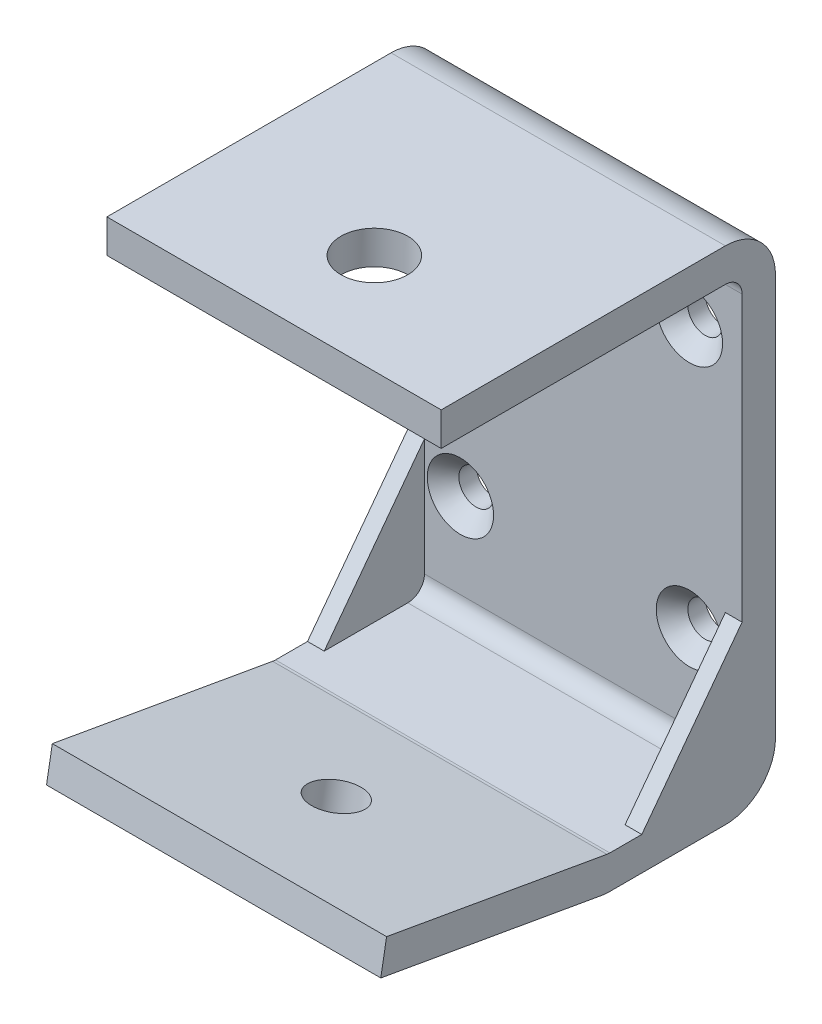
ISO-10303-21;
HEADER;
FILE_DESCRIPTION(('STEP AP214'),'2;1');
FILE_NAME('part.step','',(''),(''),'','','');
FILE_SCHEMA(('AUTOMOTIVE_DESIGN { 1 0 10303 214 1 1 1 1 }'));
ENDSEC;
DATA;
#1=APPLICATION_CONTEXT('core data for automotive mechanical design processes');
#2=APPLICATION_PROTOCOL_DEFINITION('international standard','automotive_design',2000,#1);
#3=PRODUCT_CONTEXT('',#1,'mechanical');
#4=PRODUCT('Part','Part','',(#3));
#5=PRODUCT_RELATED_PRODUCT_CATEGORY('part','',(#4));
#6=PRODUCT_DEFINITION_FORMATION('','',#4);
#7=PRODUCT_DEFINITION_CONTEXT('part definition',#1,'design');
#8=PRODUCT_DEFINITION('design','',#6,#7);
#9=PRODUCT_DEFINITION_SHAPE('','',#8);
#10=(LENGTH_UNIT() NAMED_UNIT(*) SI_UNIT(.MILLI.,.METRE.));
#11=(NAMED_UNIT(*) PLANE_ANGLE_UNIT() SI_UNIT($,.RADIAN.));
#12=(NAMED_UNIT(*) SI_UNIT($,.STERADIAN.) SOLID_ANGLE_UNIT());
#13=UNCERTAINTY_MEASURE_WITH_UNIT(LENGTH_MEASURE(1.E-05),#10,'distance_accuracy_value','');
#14=(GEOMETRIC_REPRESENTATION_CONTEXT(3) GLOBAL_UNCERTAINTY_ASSIGNED_CONTEXT((#13)) GLOBAL_UNIT_ASSIGNED_CONTEXT((#10,
#11,#12)) REPRESENTATION_CONTEXT('',''));
#15=CARTESIAN_POINT('',(0.,0.,0.));
#16=DIRECTION('',(0.,0.,1.));
#17=DIRECTION('',(1.,0.,0.));
#18=AXIS2_PLACEMENT_3D('',#15,#16,#17);
#19=CARTESIAN_POINT('',(31.75,3.175,3.175));
#20=DIRECTION('',(-1.,0.,0.));
#21=DIRECTION('',(0.,0.,1.));
#22=AXIS2_PLACEMENT_3D('',#19,#20,#21);
#23=CYLINDRICAL_SURFACE('',#22,3.175);
#24=DIRECTION('',(-1.,0.,0.));
#25=VECTOR('',#24,1.);
#26=CARTESIAN_POINT('',(31.75,3.175,0.));
#27=LINE('',#26,#25);
#28=CARTESIAN_POINT('',(28.575,3.175,0.));
#29=VERTEX_POINT('',#28);
#30=CARTESIAN_POINT('',(-28.575,3.175,0.));
#31=VERTEX_POINT('',#30);
#32=EDGE_CURVE('E327',#29,#31,#27,.T.);
#33=ORIENTED_EDGE('',*,*,#32,.T.);
#34=CARTESIAN_POINT('',(-28.575,3.175,3.175));
#35=DIRECTION('',(1.,0.,0.));
#36=DIRECTION('',(0.,0.,-1.));
#37=AXIS2_PLACEMENT_3D('',#34,#35,#36);
#38=CIRCLE('',#37,3.175);
#39=CARTESIAN_POINT('',(-28.575,0.,3.175));
#40=VERTEX_POINT('',#39);
#41=EDGE_CURVE('E198',#40,#31,#38,.T.);
#42=ORIENTED_EDGE('',*,*,#41,.F.);
#43=DIRECTION('',(-1.,0.,0.));
#44=VECTOR('',#43,1.);
#45=CARTESIAN_POINT('',(31.75,0.,3.175));
#46=LINE('',#45,#44);
#47=CARTESIAN_POINT('',(28.575,0.,3.175));
#48=VERTEX_POINT('',#47);
#49=EDGE_CURVE('E197',#48,#40,#46,.T.);
#50=ORIENTED_EDGE('',*,*,#49,.F.);
#51=CARTESIAN_POINT('',(28.575,3.175,3.175));
#52=DIRECTION('',(1.,0.,0.));
#53=DIRECTION('',(0.,0.,-1.));
#54=AXIS2_PLACEMENT_3D('',#51,#52,#53);
#55=CIRCLE('',#54,3.175);
#56=EDGE_CURVE('E210',#48,#29,#55,.T.);
#57=ORIENTED_EDGE('',*,*,#56,.T.);
#58=EDGE_LOOP('',(#33,#42,#50,#57));
#59=FACE_BOUND('',#58,.T.);
#60=ADVANCED_FACE('F39',(#59),#23,.F.);
#61=CARTESIAN_POINT('',(31.75,3.175,0.));
#62=DIRECTION('',(0.,0.,1.));
#63=DIRECTION('',(1.,0.,0.));
#64=AXIS2_PLACEMENT_3D('',#61,#62,#63);
#65=PLANE('',#64);
#66=CARTESIAN_POINT('',(-21.75,69.375,0.));
#67=DIRECTION('',(0.,0.,1.));
#68=DIRECTION('',(1.,0.,0.));
#69=AXIS2_PLACEMENT_3D('',#66,#67,#68);
#70=CIRCLE('',#69,6.3);
#71=CARTESIAN_POINT('',(-15.45,69.375,0.));
#72=VERTEX_POINT('',#71);
#73=EDGE_CURVE('E638',#72,#72,#70,.T.);
#74=ORIENTED_EDGE('',*,*,#73,.F.);
#75=EDGE_LOOP('',(#74));
#76=FACE_BOUND('',#75,.T.);
#77=CARTESIAN_POINT('',(21.75,69.375,0.));
#78=DIRECTION('',(0.,0.,1.));
#79=DIRECTION('',(1.,0.,0.));
#80=AXIS2_PLACEMENT_3D('',#77,#78,#79);
#81=CIRCLE('',#80,6.3);
#82=CARTESIAN_POINT('',(28.05,69.375,0.));
#83=VERTEX_POINT('',#82);
#84=EDGE_CURVE('E660',#83,#83,#81,.T.);
#85=ORIENTED_EDGE('',*,*,#84,.F.);
#86=EDGE_LOOP('',(#85));
#87=FACE_BOUND('',#86,.T.);
#88=CARTESIAN_POINT('',(21.75,19.375,0.));
#89=DIRECTION('',(0.,0.,1.));
#90=DIRECTION('',(1.,0.,0.));
#91=AXIS2_PLACEMENT_3D('',#88,#89,#90);
#92=CIRCLE('',#91,6.3);
#93=CARTESIAN_POINT('',(28.05,19.375,0.));
#94=VERTEX_POINT('',#93);
#95=EDGE_CURVE('E675',#94,#94,#92,.T.);
#96=ORIENTED_EDGE('',*,*,#95,.F.);
#97=EDGE_LOOP('',(#96));
#98=FACE_BOUND('',#97,.T.);
#99=CARTESIAN_POINT('',(-21.75,19.375,0.));
#100=DIRECTION('',(0.,0.,1.));
#101=DIRECTION('',(1.,0.,0.));
#102=AXIS2_PLACEMENT_3D('',#99,#100,#101);
#103=CIRCLE('',#102,6.3);
#104=CARTESIAN_POINT('',(-15.45,19.375,0.));
#105=VERTEX_POINT('',#104);
#106=EDGE_CURVE('E681',#105,#105,#103,.T.);
#107=ORIENTED_EDGE('',*,*,#106,.F.);
#108=EDGE_LOOP('',(#107));
#109=FACE_BOUND('',#108,.T.);
#110=DIRECTION('',(-1.,0.,0.));
#111=VECTOR('',#110,1.);
#112=CARTESIAN_POINT('',(-28.575,25.4,0.));
#113=LINE('',#112,#111);
#114=CARTESIAN_POINT('',(-28.575,25.4,0.));
#115=VERTEX_POINT('',#114);
#116=CARTESIAN_POINT('',(-31.75,25.4,0.));
#117=VERTEX_POINT('',#116);
#118=EDGE_CURVE('E185',#115,#117,#113,.T.);
#119=ORIENTED_EDGE('',*,*,#118,.F.);
#120=DIRECTION('',(0.,1.,0.));
#121=VECTOR('',#120,1.);
#122=CARTESIAN_POINT('',(-28.575,3.175,0.));
#123=LINE('',#122,#121);
#124=EDGE_CURVE('E192',#31,#115,#123,.T.);
#125=ORIENTED_EDGE('',*,*,#124,.F.);
#126=ORIENTED_EDGE('',*,*,#32,.F.);
#127=DIRECTION('',(0.,1.,0.));
#128=VECTOR('',#127,1.);
#129=CARTESIAN_POINT('',(28.575,3.175,0.));
#130=LINE('',#129,#128);
#131=CARTESIAN_POINT('',(28.575,25.4,0.));
#132=VERTEX_POINT('',#131);
#133=EDGE_CURVE('E62',#29,#132,#130,.T.);
#134=ORIENTED_EDGE('',*,*,#133,.T.);
#135=DIRECTION('',(1.,0.,0.));
#136=VECTOR('',#135,1.);
#137=CARTESIAN_POINT('',(28.575,25.4,0.));
#138=LINE('',#137,#136);
#139=CARTESIAN_POINT('',(31.75,25.4,0.));
#140=VERTEX_POINT('',#139);
#141=EDGE_CURVE('E219',#132,#140,#138,.T.);
#142=ORIENTED_EDGE('',*,*,#141,.T.);
#143=DIRECTION('',(0.,1.,0.));
#144=VECTOR('',#143,1.);
#145=CARTESIAN_POINT('',(31.75,3.175,0.));
#146=LINE('',#145,#144);
#147=CARTESIAN_POINT('',(31.75,79.375,0.));
#148=VERTEX_POINT('',#147);
#149=EDGE_CURVE('E239',#140,#148,#146,.T.);
#150=ORIENTED_EDGE('',*,*,#149,.T.);
#151=DIRECTION('',(-1.,0.,0.));
#152=VECTOR('',#151,1.);
#153=CARTESIAN_POINT('',(31.75,79.375,0.));
#154=LINE('',#153,#152);
#155=CARTESIAN_POINT('',(-31.75,79.375,0.));
#156=VERTEX_POINT('',#155);
#157=EDGE_CURVE('E330',#148,#156,#154,.T.);
#158=ORIENTED_EDGE('',*,*,#157,.T.);
#159=DIRECTION('',(0.,1.,0.));
#160=VECTOR('',#159,1.);
#161=CARTESIAN_POINT('',(-31.75,3.175,0.));
#162=LINE('',#161,#160);
#163=EDGE_CURVE('E277',#117,#156,#162,.T.);
#164=ORIENTED_EDGE('',*,*,#163,.F.);
#165=EDGE_LOOP('',(#119,#125,#126,#134,#142,#150,#158,#164));
#166=FACE_BOUND('',#165,.T.);
#167=ADVANCED_FACE('F419',(#76,#87,#98,#109,#166),#65,.T.);
#168=CARTESIAN_POINT('',(31.75,0.,25.1222234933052));
#169=DIRECTION('',(0.,1.,0.));
#170=DIRECTION('',(0.,0.,1.));
#171=AXIS2_PLACEMENT_3D('',#168,#169,#170);
#172=PLANE('',#171);
#173=DIRECTION('',(-1.,0.,0.));
#174=VECTOR('',#173,1.);
#175=CARTESIAN_POINT('',(-28.575,0.,19.05));
#176=LINE('',#175,#174);
#177=CARTESIAN_POINT('',(-28.575,0.,19.05));
#178=VERTEX_POINT('',#177);
#179=CARTESIAN_POINT('',(-31.75,0.,19.05));
#180=VERTEX_POINT('',#179);
#181=EDGE_CURVE('E176',#178,#180,#176,.T.);
#182=ORIENTED_EDGE('',*,*,#181,.T.);
#183=DIRECTION('',(0.,0.,-1.));
#184=VECTOR('',#183,1.);
#185=CARTESIAN_POINT('',(-31.75,0.,25.1222234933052));
#186=LINE('',#185,#184);
#187=CARTESIAN_POINT('',(-31.75,0.,25.1222234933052));
#188=VERTEX_POINT('',#187);
#189=EDGE_CURVE('E279',#188,#180,#186,.T.);
#190=ORIENTED_EDGE('',*,*,#189,.F.);
#191=DIRECTION('',(-1.,0.,0.));
#192=VECTOR('',#191,1.);
#193=CARTESIAN_POINT('',(31.75,0.,25.1222234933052));
#194=LINE('',#193,#192);
#195=CARTESIAN_POINT('',(31.75,0.,25.1222234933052));
#196=VERTEX_POINT('',#195);
#197=EDGE_CURVE('E324',#196,#188,#194,.T.);
#198=ORIENTED_EDGE('',*,*,#197,.F.);
#199=DIRECTION('',(0.,0.,-1.));
#200=VECTOR('',#199,1.);
#201=CARTESIAN_POINT('',(31.75,0.,25.1222234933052));
#202=LINE('',#201,#200);
#203=CARTESIAN_POINT('',(31.75,0.,19.05));
#204=VERTEX_POINT('',#203);
#205=EDGE_CURVE('E242',#196,#204,#202,.T.);
#206=ORIENTED_EDGE('',*,*,#205,.T.);
#207=DIRECTION('',(1.,0.,0.));
#208=VECTOR('',#207,1.);
#209=CARTESIAN_POINT('',(28.575,0.,19.05));
#210=LINE('',#209,#208);
#211=CARTESIAN_POINT('',(28.575,0.,19.05));
#212=VERTEX_POINT('',#211);
#213=EDGE_CURVE('E214',#212,#204,#210,.T.);
#214=ORIENTED_EDGE('',*,*,#213,.F.);
#215=DIRECTION('',(0.,0.,-1.));
#216=VECTOR('',#215,1.);
#217=CARTESIAN_POINT('',(28.575,0.,19.05));
#218=LINE('',#217,#216);
#219=EDGE_CURVE('E212',#212,#48,#218,.T.);
#220=ORIENTED_EDGE('',*,*,#219,.T.);
#221=ORIENTED_EDGE('',*,*,#49,.T.);
#222=DIRECTION('',(0.,0.,-1.));
#223=VECTOR('',#222,1.);
#224=CARTESIAN_POINT('',(-28.575,0.,19.05));
#225=LINE('',#224,#223);
#226=EDGE_CURVE('E189',#178,#40,#225,.T.);
#227=ORIENTED_EDGE('',*,*,#226,.F.);
#228=EDGE_LOOP('',(#182,#190,#198,#206,#214,#220,#221,#227));
#229=FACE_BOUND('',#228,.T.);
#230=ADVANCED_FACE('F195',(#229),#172,.T.);
#231=CARTESIAN_POINT('',(31.75,88.9,3.175));
#232=DIRECTION('',(0.,-1.,0.));
#233=DIRECTION('',(0.,0.,-1.));
#234=AXIS2_PLACEMENT_3D('',#231,#232,#233);
#235=PLANE('',#234);
#236=CARTESIAN_POINT('',(0.,88.9,38.1));
#237=DIRECTION('',(0.,1.,0.));
#238=DIRECTION('',(0.,0.,1.));
#239=AXIS2_PLACEMENT_3D('',#236,#237,#238);
#240=CIRCLE('',#239,6.35);
#241=CARTESIAN_POINT('',(0.,88.9,44.45));
#242=VERTEX_POINT('',#241);
#243=EDGE_CURVE('E224',#242,#242,#240,.T.);
#244=ORIENTED_EDGE('',*,*,#243,.F.);
#245=EDGE_LOOP('',(#244));
#246=FACE_BOUND('',#245,.T.);
#247=DIRECTION('',(0.,0.,1.));
#248=VECTOR('',#247,1.);
#249=CARTESIAN_POINT('',(-31.75,88.9,3.175));
#250=LINE('',#249,#248);
#251=CARTESIAN_POINT('',(-31.75,88.9,3.175));
#252=VERTEX_POINT('',#251);
#253=CARTESIAN_POINT('',(-31.75,88.9,57.15));
#254=VERTEX_POINT('',#253);
#255=EDGE_CURVE('E227',#252,#254,#250,.T.);
#256=ORIENTED_EDGE('',*,*,#255,.T.);
#257=DIRECTION('',(-1.,0.,0.));
#258=VECTOR('',#257,1.);
#259=CARTESIAN_POINT('',(31.75,88.9,57.15));
#260=LINE('',#259,#258);
#261=CARTESIAN_POINT('',(31.75,88.9,57.15));
#262=VERTEX_POINT('',#261);
#263=EDGE_CURVE('E12',#262,#254,#260,.T.);
#264=ORIENTED_EDGE('',*,*,#263,.F.);
#265=DIRECTION('',(0.,0.,1.));
#266=VECTOR('',#265,1.);
#267=CARTESIAN_POINT('',(31.75,88.9,3.175));
#268=LINE('',#267,#266);
#269=CARTESIAN_POINT('',(31.75,88.9,3.175));
#270=VERTEX_POINT('',#269);
#271=EDGE_CURVE('E228',#270,#262,#268,.T.);
#272=ORIENTED_EDGE('',*,*,#271,.F.);
#273=DIRECTION('',(-1.,0.,0.));
#274=VECTOR('',#273,1.);
#275=CARTESIAN_POINT('',(31.75,88.9,3.175));
#276=LINE('',#275,#274);
#277=EDGE_CURVE('E265',#270,#252,#276,.T.);
#278=ORIENTED_EDGE('',*,*,#277,.T.);
#279=EDGE_LOOP('',(#256,#264,#272,#278));
#280=FACE_BOUND('',#279,.T.);
#281=ADVANCED_FACE('F41',(#246,#280),#235,.F.);
#282=CARTESIAN_POINT('',(31.75,82.55,57.15));
#283=DIRECTION('',(0.,0.,1.));
#284=DIRECTION('',(1.,0.,0.));
#285=AXIS2_PLACEMENT_3D('',#282,#283,#284);
#286=PLANE('',#285);
#287=DIRECTION('',(0.,1.,0.));
#288=VECTOR('',#287,1.);
#289=CARTESIAN_POINT('',(-31.75,82.55,57.15));
#290=LINE('',#289,#288);
#291=CARTESIAN_POINT('',(-31.75,82.55,57.15));
#292=VERTEX_POINT('',#291);
#293=EDGE_CURVE('E268',#292,#254,#290,.T.);
#294=ORIENTED_EDGE('',*,*,#293,.F.);
#295=DIRECTION('',(-1.,0.,0.));
#296=VECTOR('',#295,1.);
#297=CARTESIAN_POINT('',(31.75,82.55,57.15));
#298=LINE('',#297,#296);
#299=CARTESIAN_POINT('',(31.75,82.55,57.15));
#300=VERTEX_POINT('',#299);
#301=EDGE_CURVE('E47',#300,#292,#298,.T.);
#302=ORIENTED_EDGE('',*,*,#301,.F.);
#303=DIRECTION('',(0.,1.,0.));
#304=VECTOR('',#303,1.);
#305=CARTESIAN_POINT('',(31.75,82.55,57.15));
#306=LINE('',#305,#304);
#307=EDGE_CURVE('E230',#300,#262,#306,.T.);
#308=ORIENTED_EDGE('',*,*,#307,.T.);
#309=ORIENTED_EDGE('',*,*,#263,.T.);
#310=EDGE_LOOP('',(#294,#302,#308,#309));
#311=FACE_BOUND('',#310,.T.);
#312=ADVANCED_FACE('F341',(#311),#286,.T.);
#313=CARTESIAN_POINT('',(31.75,82.55,3.175));
#314=DIRECTION('',(0.,-1.,0.));
#315=DIRECTION('',(0.,0.,-1.));
#316=AXIS2_PLACEMENT_3D('',#313,#314,#315);
#317=PLANE('',#316);
#318=CARTESIAN_POINT('',(0.,82.55,38.1));
#319=DIRECTION('',(0.,-1.,0.));
#320=DIRECTION('',(0.,0.,-1.));
#321=AXIS2_PLACEMENT_3D('',#318,#319,#320);
#322=CIRCLE('',#321,6.35);
#323=CARTESIAN_POINT('',(0.,82.55,31.75));
#324=VERTEX_POINT('',#323);
#325=EDGE_CURVE('E221',#324,#324,#322,.F.);
#326=ORIENTED_EDGE('',*,*,#325,.T.);
#327=EDGE_LOOP('',(#326));
#328=FACE_BOUND('',#327,.T.);
#329=DIRECTION('',(0.,0.,1.));
#330=VECTOR('',#329,1.);
#331=CARTESIAN_POINT('',(-31.75,82.55,3.175));
#332=LINE('',#331,#330);
#333=CARTESIAN_POINT('',(-31.75,82.55,3.175));
#334=VERTEX_POINT('',#333);
#335=EDGE_CURVE('E271',#334,#292,#332,.T.);
#336=ORIENTED_EDGE('',*,*,#335,.F.);
#337=DIRECTION('',(-1.,0.,0.));
#338=VECTOR('',#337,1.);
#339=CARTESIAN_POINT('',(31.75,82.55,3.175));
#340=LINE('',#339,#338);
#341=CARTESIAN_POINT('',(31.75,82.55,3.175));
#342=VERTEX_POINT('',#341);
#343=EDGE_CURVE('E333',#342,#334,#340,.T.);
#344=ORIENTED_EDGE('',*,*,#343,.F.);
#345=DIRECTION('',(0.,0.,1.));
#346=VECTOR('',#345,1.);
#347=CARTESIAN_POINT('',(31.75,82.55,3.175));
#348=LINE('',#347,#346);
#349=EDGE_CURVE('E234',#342,#300,#348,.T.);
#350=ORIENTED_EDGE('',*,*,#349,.T.);
#351=ORIENTED_EDGE('',*,*,#301,.T.);
#352=EDGE_LOOP('',(#336,#344,#350,#351));
#353=FACE_BOUND('',#352,.T.);
#354=ADVANCED_FACE('F337',(#328,#353),#317,.T.);
#355=CARTESIAN_POINT('',(31.75,79.375,3.175));
#356=DIRECTION('',(-1.,0.,0.));
#357=DIRECTION('',(0.,0.,1.));
#358=AXIS2_PLACEMENT_3D('',#355,#356,#357);
#359=CYLINDRICAL_SURFACE('',#358,3.175);
#360=CARTESIAN_POINT('',(-31.75,79.375,3.175));
#361=DIRECTION('',(1.,0.,0.));
#362=DIRECTION('',(0.,0.,-1.));
#363=AXIS2_PLACEMENT_3D('',#360,#361,#362);
#364=CIRCLE('',#363,3.175);
#365=EDGE_CURVE('E274',#156,#334,#364,.T.);
#366=ORIENTED_EDGE('',*,*,#365,.F.);
#367=ORIENTED_EDGE('',*,*,#157,.F.);
#368=CARTESIAN_POINT('',(31.75,79.375,3.175));
#369=DIRECTION('',(1.,0.,0.));
#370=DIRECTION('',(0.,0.,-1.));
#371=AXIS2_PLACEMENT_3D('',#368,#369,#370);
#372=CIRCLE('',#371,3.175);
#373=EDGE_CURVE('E237',#148,#342,#372,.T.);
#374=ORIENTED_EDGE('',*,*,#373,.T.);
#375=ORIENTED_EDGE('',*,*,#343,.T.);
#376=EDGE_LOOP('',(#366,#367,#374,#375));
#377=FACE_BOUND('',#376,.T.);
#378=ADVANCED_FACE('F349',(#377),#359,.F.);
#379=CARTESIAN_POINT('',(31.75,3.175,25.1222234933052));
#380=DIRECTION('',(-1.,0.,0.));
#381=DIRECTION('',(0.,0.,1.));
#382=AXIS2_PLACEMENT_3D('',#379,#380,#381);
#383=CYLINDRICAL_SURFACE('',#382,3.175);
#384=CARTESIAN_POINT('',(-31.75,3.175,25.1222234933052));
#385=DIRECTION('',(1.,0.,0.));
#386=DIRECTION('',(0.,0.,-1.));
#387=AXIS2_PLACEMENT_3D('',#384,#385,#386);
#388=CIRCLE('',#387,3.175);
#389=CARTESIAN_POINT('',(-31.75,0.0482353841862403,25.6735564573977));
#390=VERTEX_POINT('',#389);
#391=EDGE_CURVE('E281',#390,#188,#388,.T.);
#392=ORIENTED_EDGE('',*,*,#391,.F.);
#393=DIRECTION('',(-1.,0.,0.));
#394=VECTOR('',#393,1.);
#395=CARTESIAN_POINT('',(31.75,0.0482353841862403,25.6735564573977));
#396=LINE('',#395,#394);
#397=CARTESIAN_POINT('',(31.75,0.0482353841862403,25.6735564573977));
#398=VERTEX_POINT('',#397);
#399=EDGE_CURVE('E322',#398,#390,#396,.T.);
#400=ORIENTED_EDGE('',*,*,#399,.F.);
#401=CARTESIAN_POINT('',(31.75,3.175,25.1222234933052));
#402=DIRECTION('',(1.,0.,0.));
#403=DIRECTION('',(0.,0.,-1.));
#404=AXIS2_PLACEMENT_3D('',#401,#402,#403);
#405=CIRCLE('',#404,3.175);
#406=EDGE_CURVE('E244',#398,#196,#405,.T.);
#407=ORIENTED_EDGE('',*,*,#406,.T.);
#408=ORIENTED_EDGE('',*,*,#197,.T.);
#409=EDGE_LOOP('',(#392,#400,#407,#408));
#410=FACE_BOUND('',#409,.T.);
#411=ADVANCED_FACE('F396',(#410),#383,.F.);
#412=CARTESIAN_POINT('',(31.75,7.42755769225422,67.523772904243));
#413=DIRECTION('',(0.,0.984807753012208,-0.173648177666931));
#414=DIRECTION('',(0.,0.173648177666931,0.984807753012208));
#415=AXIS2_PLACEMENT_3D('',#412,#413,#414);
#416=PLANE('',#415);
#417=CARTESIAN_POINT('',(1.27328703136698E-12,3.51215941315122,45.3184458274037));
#418=DIRECTION('',(0.,0.984807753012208,-0.173648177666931));
#419=DIRECTION('',(0.,0.173648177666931,0.984807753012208));
#420=AXIS2_PLACEMENT_3D('',#417,#418,#419);
#421=CIRCLE('',#420,4.7625);
#422=CARTESIAN_POINT('',(1.27328703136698E-12,4.33915885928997,50.0085927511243));
#423=VERTEX_POINT('',#422);
#424=EDGE_CURVE('E205',#423,#423,#421,.F.);
#425=ORIENTED_EDGE('',*,*,#424,.T.);
#426=EDGE_LOOP('',(#425));
#427=FACE_BOUND('',#426,.T.);
#428=DIRECTION('',(0.,-0.173648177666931,-0.984807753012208));
#429=VECTOR('',#428,1.);
#430=CARTESIAN_POINT('',(-31.75,7.42755769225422,67.523772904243));
#431=LINE('',#430,#429);
#432=CARTESIAN_POINT('',(-31.75,7.42755769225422,67.523772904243));
#433=VERTEX_POINT('',#432);
#434=EDGE_CURVE('E284',#433,#390,#431,.T.);
#435=ORIENTED_EDGE('',*,*,#434,.F.);
#436=DIRECTION('',(-1.,0.,0.));
#437=VECTOR('',#436,1.);
#438=CARTESIAN_POINT('',(31.75,7.42755769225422,67.523772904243));
#439=LINE('',#438,#437);
#440=CARTESIAN_POINT('',(31.75,7.42755769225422,67.523772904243));
#441=VERTEX_POINT('',#440);
#442=EDGE_CURVE('E320',#441,#433,#439,.T.);
#443=ORIENTED_EDGE('',*,*,#442,.F.);
#444=DIRECTION('',(0.,-0.173648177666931,-0.984807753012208));
#445=VECTOR('',#444,1.);
#446=CARTESIAN_POINT('',(31.75,7.42755769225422,67.523772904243));
#447=LINE('',#446,#445);
#448=EDGE_CURVE('E247',#441,#398,#447,.T.);
#449=ORIENTED_EDGE('',*,*,#448,.T.);
#450=ORIENTED_EDGE('',*,*,#399,.T.);
#451=EDGE_LOOP('',(#435,#443,#449,#450));
#452=FACE_BOUND('',#451,.T.);
#453=ADVANCED_FACE('F393',(#427,#452),#416,.T.);
#454=CARTESIAN_POINT('',(31.75,1.1740284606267,68.626438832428));
#455=DIRECTION('',(0.,0.17364817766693,0.984807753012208));
#456=DIRECTION('',(0.,-0.984807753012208,0.17364817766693));
#457=AXIS2_PLACEMENT_3D('',#454,#455,#456);
#458=PLANE('',#457);
#459=DIRECTION('',(0.,0.984807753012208,-0.17364817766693));
#460=VECTOR('',#459,1.);
#461=CARTESIAN_POINT('',(-31.75,1.1740284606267,68.626438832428));
#462=LINE('',#461,#460);
#463=CARTESIAN_POINT('',(-31.75,1.1740284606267,68.626438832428));
#464=VERTEX_POINT('',#463);
#465=EDGE_CURVE('E287',#464,#433,#462,.T.);
#466=ORIENTED_EDGE('',*,*,#465,.F.);
#467=DIRECTION('',(-1.,0.,0.));
#468=VECTOR('',#467,1.);
#469=CARTESIAN_POINT('',(31.75,1.1740284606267,68.626438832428));
#470=LINE('',#469,#468);
#471=CARTESIAN_POINT('',(31.75,1.1740284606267,68.626438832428));
#472=VERTEX_POINT('',#471);
#473=EDGE_CURVE('E318',#472,#464,#470,.T.);
#474=ORIENTED_EDGE('',*,*,#473,.F.);
#475=DIRECTION('',(0.,0.984807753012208,-0.17364817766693));
#476=VECTOR('',#475,1.);
#477=CARTESIAN_POINT('',(31.75,1.1740284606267,68.626438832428));
#478=LINE('',#477,#476);
#479=EDGE_CURVE('E250',#472,#441,#478,.T.);
#480=ORIENTED_EDGE('',*,*,#479,.T.);
#481=ORIENTED_EDGE('',*,*,#442,.T.);
#482=EDGE_LOOP('',(#466,#474,#480,#481));
#483=FACE_BOUND('',#482,.T.);
#484=ADVANCED_FACE('F389',(#483),#458,.T.);
#485=CARTESIAN_POINT('',(31.75,1.1740284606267,68.626438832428));
#486=DIRECTION('',(0.,0.984807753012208,-0.173648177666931));
#487=DIRECTION('',(0.,0.173648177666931,0.984807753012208));
#488=AXIS2_PLACEMENT_3D('',#485,#486,#487);
#489=PLANE('',#488);
#490=CARTESIAN_POINT('',(1.27328703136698E-12,-2.7413698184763,46.4211117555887));
#491=DIRECTION('',(0.,-0.984807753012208,0.173648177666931));
#492=DIRECTION('',(0.,-0.173648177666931,-0.984807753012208));
#493=AXIS2_PLACEMENT_3D('',#490,#491,#492);
#494=CIRCLE('',#493,4.7625);
#495=CARTESIAN_POINT('',(1.27328703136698E-12,-3.56836926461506,41.730964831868));
#496=VERTEX_POINT('',#495);
#497=EDGE_CURVE('E691',#496,#496,#494,.T.);
#498=ORIENTED_EDGE('',*,*,#497,.F.);
#499=EDGE_LOOP('',(#498));
#500=FACE_BOUND('',#499,.T.);
#501=DIRECTION('',(0.,-0.173648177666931,-0.984807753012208));
#502=VECTOR('',#501,1.);
#503=CARTESIAN_POINT('',(-31.75,1.1740284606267,68.626438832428));
#504=LINE('',#503,#502);
#505=CARTESIAN_POINT('',(-31.75,-6.20529384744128,26.7762223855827));
#506=VERTEX_POINT('',#505);
#507=EDGE_CURVE('E290',#464,#506,#504,.T.);
#508=ORIENTED_EDGE('',*,*,#507,.T.);
#509=DIRECTION('',(-1.,0.,0.));
#510=VECTOR('',#509,1.);
#511=CARTESIAN_POINT('',(31.75,-6.20529384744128,26.7762223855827));
#512=LINE('',#511,#510);
#513=CARTESIAN_POINT('',(31.75,-6.20529384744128,26.7762223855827));
#514=VERTEX_POINT('',#513);
#515=EDGE_CURVE('E315',#514,#506,#512,.T.);
#516=ORIENTED_EDGE('',*,*,#515,.F.);
#517=DIRECTION('',(0.,-0.173648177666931,-0.984807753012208));
#518=VECTOR('',#517,1.);
#519=CARTESIAN_POINT('',(31.75,1.1740284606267,68.626438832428));
#520=LINE('',#519,#518);
#521=EDGE_CURVE('E253',#472,#514,#520,.T.);
#522=ORIENTED_EDGE('',*,*,#521,.F.);
#523=ORIENTED_EDGE('',*,*,#473,.T.);
#524=EDGE_LOOP('',(#508,#516,#522,#523));
#525=FACE_BOUND('',#524,.T.);
#526=ADVANCED_FACE('F385',(#500,#525),#489,.F.);
#527=CARTESIAN_POINT('',(31.75,3.175,25.1222234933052));
#528=DIRECTION('',(-1.,0.,0.));
#529=DIRECTION('',(0.,0.,1.));
#530=AXIS2_PLACEMENT_3D('',#527,#528,#529);
#531=CYLINDRICAL_SURFACE('',#530,9.525);
#532=CARTESIAN_POINT('',(-31.75,3.175,25.1222234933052));
#533=DIRECTION('',(1.,0.,0.));
#534=DIRECTION('',(0.,0.,-1.));
#535=AXIS2_PLACEMENT_3D('',#532,#533,#534);
#536=CIRCLE('',#535,9.525);
#537=CARTESIAN_POINT('',(-31.75,-6.35,25.1222234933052));
#538=VERTEX_POINT('',#537);
#539=EDGE_CURVE('E292',#506,#538,#536,.T.);
#540=ORIENTED_EDGE('',*,*,#539,.T.);
#541=DIRECTION('',(-1.,0.,0.));
#542=VECTOR('',#541,1.);
#543=CARTESIAN_POINT('',(31.75,-6.35,25.1222234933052));
#544=LINE('',#543,#542);
#545=CARTESIAN_POINT('',(31.75,-6.35,25.1222234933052));
#546=VERTEX_POINT('',#545);
#547=EDGE_CURVE('E312',#546,#538,#544,.T.);
#548=ORIENTED_EDGE('',*,*,#547,.F.);
#549=CARTESIAN_POINT('',(31.75,3.175,25.1222234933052));
#550=DIRECTION('',(1.,0.,0.));
#551=DIRECTION('',(0.,0.,-1.));
#552=AXIS2_PLACEMENT_3D('',#549,#550,#551);
#553=CIRCLE('',#552,9.525);
#554=EDGE_CURVE('E255',#514,#546,#553,.T.);
#555=ORIENTED_EDGE('',*,*,#554,.F.);
#556=ORIENTED_EDGE('',*,*,#515,.T.);
#557=EDGE_LOOP('',(#540,#548,#555,#556));
#558=FACE_BOUND('',#557,.T.);
#559=ADVANCED_FACE('F381',(#558),#531,.T.);
#560=CARTESIAN_POINT('',(31.75,-6.35,25.1222234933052));
#561=DIRECTION('',(0.,1.,0.));
#562=DIRECTION('',(0.,0.,1.));
#563=AXIS2_PLACEMENT_3D('',#560,#561,#562);
#564=PLANE('',#563);
#565=DIRECTION('',(0.,0.,-1.));
#566=VECTOR('',#565,1.);
#567=CARTESIAN_POINT('',(-31.75,-6.35,25.1222234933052));
#568=LINE('',#567,#566);
#569=CARTESIAN_POINT('',(-31.75,-6.35,3.175));
#570=VERTEX_POINT('',#569);
#571=EDGE_CURVE('E294',#538,#570,#568,.T.);
#572=ORIENTED_EDGE('',*,*,#571,.T.);
#573=DIRECTION('',(-1.,0.,0.));
#574=VECTOR('',#573,1.);
#575=CARTESIAN_POINT('',(31.75,-6.35,3.175));
#576=LINE('',#575,#574);
#577=CARTESIAN_POINT('',(31.75,-6.35,3.175));
#578=VERTEX_POINT('',#577);
#579=EDGE_CURVE('E309',#578,#570,#576,.T.);
#580=ORIENTED_EDGE('',*,*,#579,.F.);
#581=DIRECTION('',(0.,0.,-1.));
#582=VECTOR('',#581,1.);
#583=CARTESIAN_POINT('',(31.75,-6.35,25.1222234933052));
#584=LINE('',#583,#582);
#585=EDGE_CURVE('E257',#546,#578,#584,.T.);
#586=ORIENTED_EDGE('',*,*,#585,.F.);
#587=ORIENTED_EDGE('',*,*,#547,.T.);
#588=EDGE_LOOP('',(#572,#580,#586,#587));
#589=FACE_BOUND('',#588,.T.);
#590=ADVANCED_FACE('F376',(#589),#564,.F.);
#591=CARTESIAN_POINT('',(31.75,3.175,3.175));
#592=DIRECTION('',(-1.,0.,0.));
#593=DIRECTION('',(0.,0.,1.));
#594=AXIS2_PLACEMENT_3D('',#591,#592,#593);
#595=CYLINDRICAL_SURFACE('',#594,9.525);
#596=CARTESIAN_POINT('',(-31.75,3.175,3.175));
#597=DIRECTION('',(1.,0.,0.));
#598=DIRECTION('',(0.,0.,-1.));
#599=AXIS2_PLACEMENT_3D('',#596,#597,#598);
#600=CIRCLE('',#599,9.525);
#601=CARTESIAN_POINT('',(-31.75,3.175,-6.35));
#602=VERTEX_POINT('',#601);
#603=EDGE_CURVE('E296',#570,#602,#600,.T.);
#604=ORIENTED_EDGE('',*,*,#603,.T.);
#605=DIRECTION('',(-1.,0.,0.));
#606=VECTOR('',#605,1.);
#607=CARTESIAN_POINT('',(31.75,3.175,-6.35));
#608=LINE('',#607,#606);
#609=CARTESIAN_POINT('',(31.75,3.175,-6.35));
#610=VERTEX_POINT('',#609);
#611=EDGE_CURVE('E306',#610,#602,#608,.T.);
#612=ORIENTED_EDGE('',*,*,#611,.F.);
#613=CARTESIAN_POINT('',(31.75,3.175,3.175));
#614=DIRECTION('',(1.,0.,0.));
#615=DIRECTION('',(0.,0.,-1.));
#616=AXIS2_PLACEMENT_3D('',#613,#614,#615);
#617=CIRCLE('',#616,9.525);
#618=EDGE_CURVE('E259',#578,#610,#617,.T.);
#619=ORIENTED_EDGE('',*,*,#618,.F.);
#620=ORIENTED_EDGE('',*,*,#579,.T.);
#621=EDGE_LOOP('',(#604,#612,#619,#620));
#622=FACE_BOUND('',#621,.T.);
#623=ADVANCED_FACE('F370',(#622),#595,.T.);
#624=CARTESIAN_POINT('',(31.75,3.175,-6.35));
#625=DIRECTION('',(0.,0.,1.));
#626=DIRECTION('',(1.,0.,0.));
#627=AXIS2_PLACEMENT_3D('',#624,#625,#626);
#628=PLANE('',#627);
#629=CARTESIAN_POINT('',(-21.75,69.375,-6.35));
#630=DIRECTION('',(0.,0.,1.));
#631=DIRECTION('',(1.,0.,0.));
#632=AXIS2_PLACEMENT_3D('',#629,#630,#631);
#633=CIRCLE('',#632,3.29999999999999);
#634=CARTESIAN_POINT('',(-18.45,69.375,-6.35));
#635=VERTEX_POINT('',#634);
#636=EDGE_CURVE('E640',#635,#635,#633,.T.);
#637=ORIENTED_EDGE('',*,*,#636,.T.);
#638=EDGE_LOOP('',(#637));
#639=FACE_BOUND('',#638,.T.);
#640=CARTESIAN_POINT('',(21.75,69.375,-6.35));
#641=DIRECTION('',(0.,0.,1.));
#642=DIRECTION('',(1.,0.,0.));
#643=AXIS2_PLACEMENT_3D('',#640,#641,#642);
#644=CIRCLE('',#643,3.29999999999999);
#645=CARTESIAN_POINT('',(25.05,69.375,-6.35));
#646=VERTEX_POINT('',#645);
#647=EDGE_CURVE('E659',#646,#646,#644,.T.);
#648=ORIENTED_EDGE('',*,*,#647,.T.);
#649=EDGE_LOOP('',(#648));
#650=FACE_BOUND('',#649,.T.);
#651=CARTESIAN_POINT('',(21.75,19.375,-6.35));
#652=DIRECTION('',(0.,0.,1.));
#653=DIRECTION('',(1.,0.,0.));
#654=AXIS2_PLACEMENT_3D('',#651,#652,#653);
#655=CIRCLE('',#654,3.29999999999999);
#656=CARTESIAN_POINT('',(25.05,19.375,-6.35));
#657=VERTEX_POINT('',#656);
#658=EDGE_CURVE('E674',#657,#657,#655,.T.);
#659=ORIENTED_EDGE('',*,*,#658,.T.);
#660=EDGE_LOOP('',(#659));
#661=FACE_BOUND('',#660,.T.);
#662=CARTESIAN_POINT('',(-21.75,19.375,-6.35));
#663=DIRECTION('',(0.,0.,1.));
#664=DIRECTION('',(1.,0.,0.));
#665=AXIS2_PLACEMENT_3D('',#662,#663,#664);
#666=CIRCLE('',#665,3.29999999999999);
#667=CARTESIAN_POINT('',(-18.45,19.375,-6.35));
#668=VERTEX_POINT('',#667);
#669=EDGE_CURVE('E688',#668,#668,#666,.T.);
#670=ORIENTED_EDGE('',*,*,#669,.T.);
#671=EDGE_LOOP('',(#670));
#672=FACE_BOUND('',#671,.T.);
#673=DIRECTION('',(0.,1.,0.));
#674=VECTOR('',#673,1.);
#675=CARTESIAN_POINT('',(-31.75,3.175,-6.35));
#676=LINE('',#675,#674);
#677=CARTESIAN_POINT('',(-31.75,79.375,-6.35));
#678=VERTEX_POINT('',#677);
#679=EDGE_CURVE('E298',#602,#678,#676,.T.);
#680=ORIENTED_EDGE('',*,*,#679,.T.);
#681=DIRECTION('',(-1.,0.,0.));
#682=VECTOR('',#681,1.);
#683=CARTESIAN_POINT('',(31.75,79.375,-6.35));
#684=LINE('',#683,#682);
#685=CARTESIAN_POINT('',(31.75,79.375,-6.35));
#686=VERTEX_POINT('',#685);
#687=EDGE_CURVE('E303',#686,#678,#684,.T.);
#688=ORIENTED_EDGE('',*,*,#687,.F.);
#689=DIRECTION('',(0.,1.,0.));
#690=VECTOR('',#689,1.);
#691=CARTESIAN_POINT('',(31.75,3.175,-6.35));
#692=LINE('',#691,#690);
#693=EDGE_CURVE('E261',#610,#686,#692,.T.);
#694=ORIENTED_EDGE('',*,*,#693,.F.);
#695=ORIENTED_EDGE('',*,*,#611,.T.);
#696=EDGE_LOOP('',(#680,#688,#694,#695));
#697=FACE_BOUND('',#696,.T.);
#698=ADVANCED_FACE('F366',(#639,#650,#661,#672,#697),#628,.F.);
#699=CARTESIAN_POINT('',(31.75,79.375,3.175));
#700=DIRECTION('',(-1.,0.,0.));
#701=DIRECTION('',(0.,0.,1.));
#702=AXIS2_PLACEMENT_3D('',#699,#700,#701);
#703=CYLINDRICAL_SURFACE('',#702,9.525);
#704=CARTESIAN_POINT('',(-31.75,79.375,3.175));
#705=DIRECTION('',(1.,0.,0.));
#706=DIRECTION('',(0.,0.,-1.));
#707=AXIS2_PLACEMENT_3D('',#704,#705,#706);
#708=CIRCLE('',#707,9.525);
#709=EDGE_CURVE('E231',#678,#252,#708,.T.);
#710=ORIENTED_EDGE('',*,*,#709,.T.);
#711=ORIENTED_EDGE('',*,*,#277,.F.);
#712=CARTESIAN_POINT('',(31.75,79.375,3.175));
#713=DIRECTION('',(1.,0.,0.));
#714=DIRECTION('',(0.,0.,-1.));
#715=AXIS2_PLACEMENT_3D('',#712,#713,#714);
#716=CIRCLE('',#715,9.525);
#717=EDGE_CURVE('E263',#686,#270,#716,.T.);
#718=ORIENTED_EDGE('',*,*,#717,.F.);
#719=ORIENTED_EDGE('',*,*,#687,.T.);
#720=EDGE_LOOP('',(#710,#711,#718,#719));
#721=FACE_BOUND('',#720,.T.);
#722=ADVANCED_FACE('F362',(#721),#703,.T.);
#723=CARTESIAN_POINT('',(31.75,79.375,3.175));
#724=DIRECTION('',(1.,0.,0.));
#725=DIRECTION('',(0.,0.,-1.));
#726=AXIS2_PLACEMENT_3D('',#723,#724,#725);
#727=PLANE('',#726);
#728=ORIENTED_EDGE('',*,*,#149,.F.);
#729=DIRECTION('',(0.,0.8,-0.6));
#730=VECTOR('',#729,1.);
#731=CARTESIAN_POINT('',(31.75,0.,19.05));
#732=LINE('',#731,#730);
#733=EDGE_CURVE('E184',#204,#140,#732,.T.);
#734=ORIENTED_EDGE('',*,*,#733,.F.);
#735=ORIENTED_EDGE('',*,*,#205,.F.);
#736=ORIENTED_EDGE('',*,*,#406,.F.);
#737=ORIENTED_EDGE('',*,*,#448,.F.);
#738=ORIENTED_EDGE('',*,*,#479,.F.);
#739=ORIENTED_EDGE('',*,*,#521,.T.);
#740=ORIENTED_EDGE('',*,*,#554,.T.);
#741=ORIENTED_EDGE('',*,*,#585,.T.);
#742=ORIENTED_EDGE('',*,*,#618,.T.);
#743=ORIENTED_EDGE('',*,*,#693,.T.);
#744=ORIENTED_EDGE('',*,*,#717,.T.);
#745=ORIENTED_EDGE('',*,*,#271,.T.);
#746=ORIENTED_EDGE('',*,*,#307,.F.);
#747=ORIENTED_EDGE('',*,*,#349,.F.);
#748=ORIENTED_EDGE('',*,*,#373,.F.);
#749=EDGE_LOOP('',(#728,#734,#735,#736,#737,#738,#739,#740,#741,#742,#743,#744,#745,#746,#747,#748));
#750=FACE_BOUND('',#749,.T.);
#751=ADVANCED_FACE('F353',(#750),#727,.T.);
#752=CARTESIAN_POINT('',(-31.75,79.375,3.175));
#753=DIRECTION('',(1.,0.,0.));
#754=DIRECTION('',(0.,0.,-1.));
#755=AXIS2_PLACEMENT_3D('',#752,#753,#754);
#756=PLANE('',#755);
#757=ORIENTED_EDGE('',*,*,#255,.F.);
#758=ORIENTED_EDGE('',*,*,#709,.F.);
#759=ORIENTED_EDGE('',*,*,#679,.F.);
#760=ORIENTED_EDGE('',*,*,#603,.F.);
#761=ORIENTED_EDGE('',*,*,#571,.F.);
#762=ORIENTED_EDGE('',*,*,#539,.F.);
#763=ORIENTED_EDGE('',*,*,#507,.F.);
#764=ORIENTED_EDGE('',*,*,#465,.T.);
#765=ORIENTED_EDGE('',*,*,#434,.T.);
#766=ORIENTED_EDGE('',*,*,#391,.T.);
#767=ORIENTED_EDGE('',*,*,#189,.T.);
#768=DIRECTION('',(0.,0.8,-0.6));
#769=VECTOR('',#768,1.);
#770=CARTESIAN_POINT('',(-31.75,0.,19.05));
#771=LINE('',#770,#769);
#772=EDGE_CURVE('E54',#180,#117,#771,.T.);
#773=ORIENTED_EDGE('',*,*,#772,.T.);
#774=ORIENTED_EDGE('',*,*,#163,.T.);
#775=ORIENTED_EDGE('',*,*,#365,.T.);
#776=ORIENTED_EDGE('',*,*,#335,.T.);
#777=ORIENTED_EDGE('',*,*,#293,.T.);
#778=EDGE_LOOP('',(#757,#758,#759,#760,#761,#762,#763,#764,#765,#766,#767,#773,#774,#775,#776,#777));
#779=FACE_BOUND('',#778,.T.);
#780=ADVANCED_FACE('F344',(#779),#756,.F.);
#781=CARTESIAN_POINT('',(0.,-6.35100000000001,38.1000000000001));
#782=DIRECTION('',(0.,1.,0.));
#783=DIRECTION('',(0.,0.,1.));
#784=AXIS2_PLACEMENT_3D('',#781,#782,#783);
#785=CYLINDRICAL_SURFACE('',#784,6.35);
#786=ORIENTED_EDGE('',*,*,#325,.F.);
#787=EDGE_LOOP('',(#786));
#788=FACE_BOUND('',#787,.T.);
#789=ORIENTED_EDGE('',*,*,#243,.T.);
#790=EDGE_LOOP('',(#789));
#791=FACE_BOUND('',#790,.T.);
#792=ADVANCED_FACE('F416',(#788,#791),#785,.F.);
#793=CARTESIAN_POINT('',(28.575,0.,19.05));
#794=DIRECTION('',(0.,-0.6,-0.8));
#795=DIRECTION('',(0.,0.8,-0.6));
#796=AXIS2_PLACEMENT_3D('',#793,#794,#795);
#797=PLANE('',#796);
#798=ORIENTED_EDGE('',*,*,#733,.T.);
#799=ORIENTED_EDGE('',*,*,#141,.F.);
#800=DIRECTION('',(0.,0.8,-0.6));
#801=VECTOR('',#800,1.);
#802=CARTESIAN_POINT('',(28.575,0.,19.05));
#803=LINE('',#802,#801);
#804=EDGE_CURVE('E207',#212,#132,#803,.T.);
#805=ORIENTED_EDGE('',*,*,#804,.F.);
#806=ORIENTED_EDGE('',*,*,#213,.T.);
#807=EDGE_LOOP('',(#798,#799,#805,#806));
#808=FACE_BOUND('',#807,.T.);
#809=ADVANCED_FACE('F402',(#808),#797,.F.);
#810=CARTESIAN_POINT('',(28.575,3.175,3.175));
#811=DIRECTION('',(1.,0.,0.));
#812=DIRECTION('',(0.,0.,-1.));
#813=AXIS2_PLACEMENT_3D('',#810,#811,#812);
#814=PLANE('',#813);
#815=ORIENTED_EDGE('',*,*,#804,.T.);
#816=ORIENTED_EDGE('',*,*,#133,.F.);
#817=ORIENTED_EDGE('',*,*,#56,.F.);
#818=ORIENTED_EDGE('',*,*,#219,.F.);
#819=EDGE_LOOP('',(#815,#816,#817,#818));
#820=FACE_BOUND('',#819,.T.);
#821=ADVANCED_FACE('F408',(#820),#814,.F.);
#822=CARTESIAN_POINT('',(-28.575,0.,19.05));
#823=DIRECTION('',(0.,0.6,0.8));
#824=DIRECTION('',(0.,-0.8,0.6));
#825=AXIS2_PLACEMENT_3D('',#822,#823,#824);
#826=PLANE('',#825);
#827=ORIENTED_EDGE('',*,*,#772,.F.);
#828=ORIENTED_EDGE('',*,*,#181,.F.);
#829=DIRECTION('',(0.,0.8,-0.6));
#830=VECTOR('',#829,1.);
#831=CARTESIAN_POINT('',(-28.575,0.,19.05));
#832=LINE('',#831,#830);
#833=EDGE_CURVE('E179',#178,#115,#832,.T.);
#834=ORIENTED_EDGE('',*,*,#833,.T.);
#835=ORIENTED_EDGE('',*,*,#118,.T.);
#836=EDGE_LOOP('',(#827,#828,#834,#835));
#837=FACE_BOUND('',#836,.T.);
#838=ADVANCED_FACE('F178',(#837),#826,.T.);
#839=CARTESIAN_POINT('',(-28.575,3.175,3.175));
#840=DIRECTION('',(-1.,0.,0.));
#841=DIRECTION('',(0.,0.,-1.));
#842=AXIS2_PLACEMENT_3D('',#839,#840,#841);
#843=PLANE('',#842);
#844=ORIENTED_EDGE('',*,*,#833,.F.);
#845=ORIENTED_EDGE('',*,*,#226,.T.);
#846=ORIENTED_EDGE('',*,*,#41,.T.);
#847=ORIENTED_EDGE('',*,*,#124,.T.);
#848=EDGE_LOOP('',(#844,#845,#846,#847));
#849=FACE_BOUND('',#848,.T.);
#850=ADVANCED_FACE('F188',(#849),#843,.F.);
#851=CARTESIAN_POINT('',(1.27328703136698E-12,16.7778981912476,42.9793381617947));
#852=DIRECTION('',(0.,-0.984807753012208,0.173648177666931));
#853=DIRECTION('',(0.,-0.173648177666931,-0.984807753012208));
#854=AXIS2_PLACEMENT_3D('',#851,#852,#853);
#855=CYLINDRICAL_SURFACE('',#854,4.7625);
#856=ORIENTED_EDGE('',*,*,#497,.T.);
#857=EDGE_LOOP('',(#856));
#858=FACE_BOUND('',#857,.T.);
#859=ORIENTED_EDGE('',*,*,#424,.F.);
#860=EDGE_LOOP('',(#859));
#861=FACE_BOUND('',#860,.T.);
#862=ADVANCED_FACE('F540',(#858,#861),#855,.F.);
#863=CARTESIAN_POINT('',(-21.75,19.375,0.));
#864=DIRECTION('',(0.,0.,1.));
#865=DIRECTION('',(1.,0.,0.));
#866=AXIS2_PLACEMENT_3D('',#863,#864,#865);
#867=CYLINDRICAL_SURFACE('',#866,3.29999999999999);
#868=ORIENTED_EDGE('',*,*,#669,.F.);
#869=EDGE_LOOP('',(#868));
#870=FACE_BOUND('',#869,.T.);
#871=CARTESIAN_POINT('',(-21.75,19.375,-3.));
#872=DIRECTION('',(0.,0.,1.));
#873=DIRECTION('',(1.,0.,0.));
#874=AXIS2_PLACEMENT_3D('',#871,#872,#873);
#875=CIRCLE('',#874,3.29999999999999);
#876=CARTESIAN_POINT('',(-18.45,19.375,-3.));
#877=VERTEX_POINT('',#876);
#878=EDGE_CURVE('E684',#877,#877,#875,.T.);
#879=ORIENTED_EDGE('',*,*,#878,.T.);
#880=EDGE_LOOP('',(#879));
#881=FACE_BOUND('',#880,.T.);
#882=ADVANCED_FACE('F549',(#870,#881),#867,.F.);
#883=CARTESIAN_POINT('',(-21.75,19.375,0.));
#884=DIRECTION('',(0.,0.,1.));
#885=DIRECTION('',(1.,0.,0.));
#886=AXIS2_PLACEMENT_3D('',#883,#884,#885);
#887=CONICAL_SURFACE('',#886,6.3,0.785398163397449);
#888=ORIENTED_EDGE('',*,*,#878,.F.);
#889=EDGE_LOOP('',(#888));
#890=FACE_BOUND('',#889,.T.);
#891=ORIENTED_EDGE('',*,*,#106,.T.);
#892=EDGE_LOOP('',(#891));
#893=FACE_BOUND('',#892,.T.);
#894=ADVANCED_FACE('F555',(#890,#893),#887,.F.);
#895=CARTESIAN_POINT('',(21.75,19.375,0.));
#896=DIRECTION('',(0.,0.,1.));
#897=DIRECTION('',(1.,0.,0.));
#898=AXIS2_PLACEMENT_3D('',#895,#896,#897);
#899=CYLINDRICAL_SURFACE('',#898,3.29999999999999);
#900=ORIENTED_EDGE('',*,*,#658,.F.);
#901=EDGE_LOOP('',(#900));
#902=FACE_BOUND('',#901,.T.);
#903=CARTESIAN_POINT('',(21.75,19.375,-3.));
#904=DIRECTION('',(0.,0.,1.));
#905=DIRECTION('',(1.,0.,0.));
#906=AXIS2_PLACEMENT_3D('',#903,#904,#905);
#907=CIRCLE('',#906,3.29999999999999);
#908=CARTESIAN_POINT('',(25.05,19.375,-3.));
#909=VERTEX_POINT('',#908);
#910=EDGE_CURVE('E670',#909,#909,#907,.T.);
#911=ORIENTED_EDGE('',*,*,#910,.T.);
#912=EDGE_LOOP('',(#911));
#913=FACE_BOUND('',#912,.T.);
#914=ADVANCED_FACE('F563',(#902,#913),#899,.F.);
#915=CARTESIAN_POINT('',(21.75,19.375,0.));
#916=DIRECTION('',(0.,0.,1.));
#917=DIRECTION('',(1.,0.,0.));
#918=AXIS2_PLACEMENT_3D('',#915,#916,#917);
#919=CONICAL_SURFACE('',#918,6.3,0.785398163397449);
#920=ORIENTED_EDGE('',*,*,#910,.F.);
#921=EDGE_LOOP('',(#920));
#922=FACE_BOUND('',#921,.T.);
#923=ORIENTED_EDGE('',*,*,#95,.T.);
#924=EDGE_LOOP('',(#923));
#925=FACE_BOUND('',#924,.T.);
#926=ADVANCED_FACE('F571',(#922,#925),#919,.F.);
#927=CARTESIAN_POINT('',(21.75,69.375,0.));
#928=DIRECTION('',(0.,0.,1.));
#929=DIRECTION('',(1.,0.,0.));
#930=AXIS2_PLACEMENT_3D('',#927,#928,#929);
#931=CYLINDRICAL_SURFACE('',#930,3.29999999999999);
#932=ORIENTED_EDGE('',*,*,#647,.F.);
#933=EDGE_LOOP('',(#932));
#934=FACE_BOUND('',#933,.T.);
#935=CARTESIAN_POINT('',(21.75,69.375,-3.));
#936=DIRECTION('',(0.,0.,1.));
#937=DIRECTION('',(1.,0.,0.));
#938=AXIS2_PLACEMENT_3D('',#935,#936,#937);
#939=CIRCLE('',#938,3.29999999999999);
#940=CARTESIAN_POINT('',(25.05,69.375,-3.));
#941=VERTEX_POINT('',#940);
#942=EDGE_CURVE('E654',#941,#941,#939,.T.);
#943=ORIENTED_EDGE('',*,*,#942,.T.);
#944=EDGE_LOOP('',(#943));
#945=FACE_BOUND('',#944,.T.);
#946=ADVANCED_FACE('F579',(#934,#945),#931,.F.);
#947=CARTESIAN_POINT('',(21.75,69.375,0.));
#948=DIRECTION('',(0.,0.,1.));
#949=DIRECTION('',(1.,0.,0.));
#950=AXIS2_PLACEMENT_3D('',#947,#948,#949);
#951=CONICAL_SURFACE('',#950,6.3,0.785398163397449);
#952=ORIENTED_EDGE('',*,*,#942,.F.);
#953=EDGE_LOOP('',(#952));
#954=FACE_BOUND('',#953,.T.);
#955=ORIENTED_EDGE('',*,*,#84,.T.);
#956=EDGE_LOOP('',(#955));
#957=FACE_BOUND('',#956,.T.);
#958=ADVANCED_FACE('F587',(#954,#957),#951,.F.);
#959=CARTESIAN_POINT('',(-21.75,69.375,0.));
#960=DIRECTION('',(0.,0.,1.));
#961=DIRECTION('',(1.,0.,0.));
#962=AXIS2_PLACEMENT_3D('',#959,#960,#961);
#963=CYLINDRICAL_SURFACE('',#962,3.29999999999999);
#964=ORIENTED_EDGE('',*,*,#636,.F.);
#965=EDGE_LOOP('',(#964));
#966=FACE_BOUND('',#965,.T.);
#967=CARTESIAN_POINT('',(-21.75,69.375,-3.));
#968=DIRECTION('',(0.,0.,1.));
#969=DIRECTION('',(1.,0.,0.));
#970=AXIS2_PLACEMENT_3D('',#967,#968,#969);
#971=CIRCLE('',#970,3.29999999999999);
#972=CARTESIAN_POINT('',(-18.45,69.375,-3.));
#973=VERTEX_POINT('',#972);
#974=EDGE_CURVE('E635',#973,#973,#971,.T.);
#975=ORIENTED_EDGE('',*,*,#974,.T.);
#976=EDGE_LOOP('',(#975));
#977=FACE_BOUND('',#976,.T.);
#978=ADVANCED_FACE('F595',(#966,#977),#963,.F.);
#979=CARTESIAN_POINT('',(-21.75,69.375,0.));
#980=DIRECTION('',(0.,0.,1.));
#981=DIRECTION('',(1.,0.,0.));
#982=AXIS2_PLACEMENT_3D('',#979,#980,#981);
#983=CONICAL_SURFACE('',#982,6.3,0.785398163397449);
#984=ORIENTED_EDGE('',*,*,#974,.F.);
#985=EDGE_LOOP('',(#984));
#986=FACE_BOUND('',#985,.T.);
#987=ORIENTED_EDGE('',*,*,#73,.T.);
#988=EDGE_LOOP('',(#987));
#989=FACE_BOUND('',#988,.T.);
#990=ADVANCED_FACE('F603',(#986,#989),#983,.F.);
#991=CLOSED_SHELL('',(#60,#167,#230,#281,#312,#354,#378,#411,#453,#484,#526,#559,#590,#623,#698,
#722,#751,#780,#792,#809,#821,#838,#850,#862,#882,#894,#914,#926,#946,#958,#978,#990));
#992=MANIFOLD_SOLID_BREP('B2',#991);
#993=ADVANCED_BREP_SHAPE_REPRESENTATION('',(#18,#992),#14);
#994=SHAPE_DEFINITION_REPRESENTATION(#9,#993);
ENDSEC;
END-ISO-10303-21;
